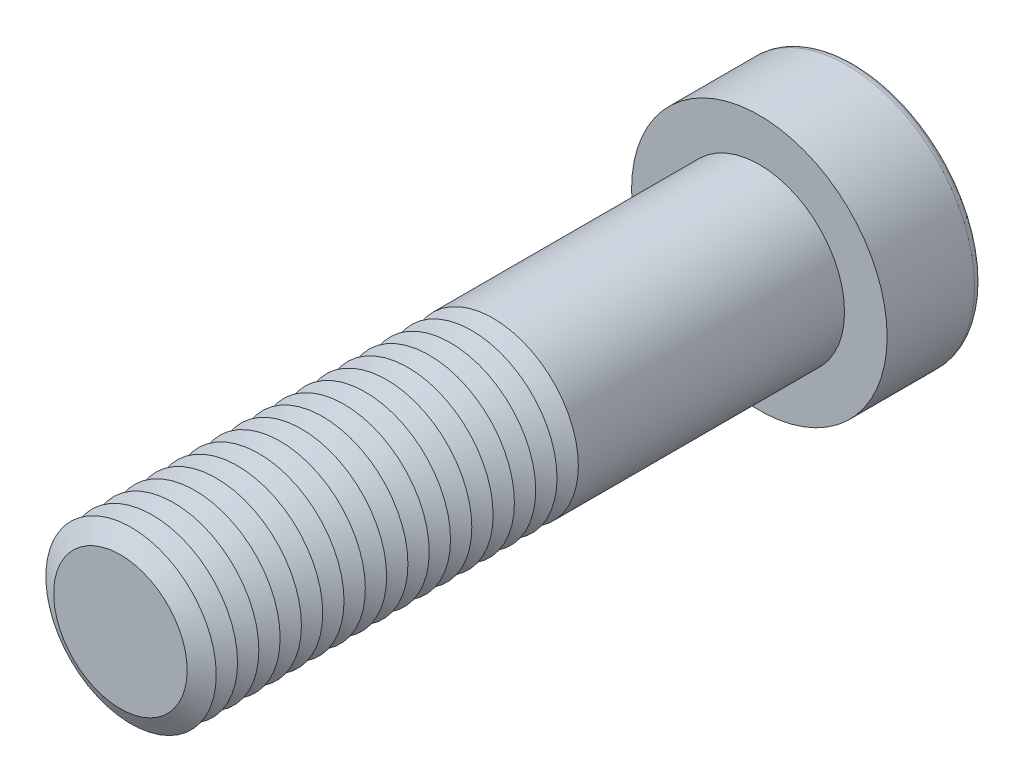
ISO-10303-21;
HEADER;
FILE_DESCRIPTION(('STEP AP214'),'2;1');
FILE_NAME('part.step','',(''),(''),'','','');
FILE_SCHEMA(('AUTOMOTIVE_DESIGN { 1 0 10303 214 1 1 1 1 }'));
ENDSEC;
DATA;
#1=APPLICATION_CONTEXT('core data for automotive mechanical design processes');
#2=APPLICATION_PROTOCOL_DEFINITION('international standard','automotive_design',2000,#1);
#3=PRODUCT_CONTEXT('',#1,'mechanical');
#4=PRODUCT('Part','Part','',(#3));
#5=PRODUCT_RELATED_PRODUCT_CATEGORY('part','',(#4));
#6=PRODUCT_DEFINITION_FORMATION('','',#4);
#7=PRODUCT_DEFINITION_CONTEXT('part definition',#1,'design');
#8=PRODUCT_DEFINITION('design','',#6,#7);
#9=PRODUCT_DEFINITION_SHAPE('','',#8);
#10=(LENGTH_UNIT() NAMED_UNIT(*) SI_UNIT(.MILLI.,.METRE.));
#11=(NAMED_UNIT(*) PLANE_ANGLE_UNIT() SI_UNIT($,.RADIAN.));
#12=(NAMED_UNIT(*) SI_UNIT($,.STERADIAN.) SOLID_ANGLE_UNIT());
#13=UNCERTAINTY_MEASURE_WITH_UNIT(LENGTH_MEASURE(1.E-05),#10,'distance_accuracy_value','');
#14=(GEOMETRIC_REPRESENTATION_CONTEXT(3) GLOBAL_UNCERTAINTY_ASSIGNED_CONTEXT((#13)) GLOBAL_UNIT_ASSIGNED_CONTEXT((#10,
#11,#12)) REPRESENTATION_CONTEXT('',''));
#15=CARTESIAN_POINT('',(0.,0.,0.));
#16=DIRECTION('',(0.,0.,1.));
#17=DIRECTION('',(1.,0.,0.));
#18=AXIS2_PLACEMENT_3D('',#15,#16,#17);
#19=CARTESIAN_POINT('',(0.,0.,53.));
#20=DIRECTION('',(0.,0.,1.));
#21=DIRECTION('',(1.,0.,0.));
#22=AXIS2_PLACEMENT_3D('',#19,#20,#21);
#23=CONICAL_SURFACE('',#22,8.,1.0471975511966);
#24=CARTESIAN_POINT('',(0.,0.,52.));
#25=DIRECTION('',(0.,0.,1.));
#26=DIRECTION('',(1.,0.,0.));
#27=AXIS2_PLACEMENT_3D('',#24,#25,#26);
#28=CIRCLE('',#27,6.26794919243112);
#29=CARTESIAN_POINT('',(6.26794919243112,0.,52.));
#30=VERTEX_POINT('',#29);
#31=EDGE_CURVE('E313',#30,#30,#28,.T.);
#32=ORIENTED_EDGE('',*,*,#31,.T.);
#33=EDGE_LOOP('',(#32));
#34=FACE_BOUND('',#33,.T.);
#35=CARTESIAN_POINT('',(0.,0.,53.));
#36=DIRECTION('',(0.,0.,1.));
#37=DIRECTION('',(1.,0.,0.));
#38=AXIS2_PLACEMENT_3D('',#35,#36,#37);
#39=CIRCLE('',#38,8.);
#40=CARTESIAN_POINT('',(8.,0.,53.));
#41=VERTEX_POINT('',#40);
#42=EDGE_CURVE('E316',#41,#41,#39,.T.);
#43=ORIENTED_EDGE('',*,*,#42,.F.);
#44=EDGE_LOOP('',(#43));
#45=FACE_BOUND('',#44,.T.);
#46=ADVANCED_FACE('F39',(#34,#45),#23,.T.);
#47=CARTESIAN_POINT('',(0.,0.,52.));
#48=DIRECTION('',(0.,0.,-1.));
#49=DIRECTION('',(-1.,0.,0.));
#50=AXIS2_PLACEMENT_3D('',#47,#48,#49);
#51=CONICAL_SURFACE('',#50,6.26794919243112,1.0471975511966);
#52=CARTESIAN_POINT('',(0.,0.,51.));
#53=DIRECTION('',(0.,0.,1.));
#54=DIRECTION('',(1.,0.,0.));
#55=AXIS2_PLACEMENT_3D('',#52,#53,#54);
#56=CIRCLE('',#55,8.);
#57=CARTESIAN_POINT('',(8.,0.,51.));
#58=VERTEX_POINT('',#57);
#59=EDGE_CURVE('E324',#58,#58,#56,.T.);
#60=ORIENTED_EDGE('',*,*,#59,.T.);
#61=EDGE_LOOP('',(#60));
#62=FACE_BOUND('',#61,.T.);
#63=ORIENTED_EDGE('',*,*,#31,.F.);
#64=EDGE_LOOP('',(#63));
#65=FACE_BOUND('',#64,.T.);
#66=ADVANCED_FACE('F244',(#62,#65),#51,.T.);
#67=CARTESIAN_POINT('',(0.,0.,60.));
#68=DIRECTION('',(0.,0.,1.));
#69=DIRECTION('',(1.,0.,0.));
#70=AXIS2_PLACEMENT_3D('',#67,#68,#69);
#71=PLANE('',#70);
#72=CARTESIAN_POINT('',(0.,0.,60.));
#73=DIRECTION('',(0.,0.,1.));
#74=DIRECTION('',(1.,0.,0.));
#75=AXIS2_PLACEMENT_3D('',#72,#73,#74);
#76=CIRCLE('',#75,6.26794919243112);
#77=CARTESIAN_POINT('',(6.26794919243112,0.,60.));
#78=VERTEX_POINT('',#77);
#79=EDGE_CURVE('E173',#78,#78,#76,.T.);
#80=ORIENTED_EDGE('',*,*,#79,.T.);
#81=EDGE_LOOP('',(#80));
#82=FACE_BOUND('',#81,.T.);
#83=ADVANCED_FACE('F250',(#82),#71,.T.);
#84=CARTESIAN_POINT('',(0.,0.,60.));
#85=DIRECTION('',(0.,0.,-1.));
#86=DIRECTION('',(-1.,0.,0.));
#87=AXIS2_PLACEMENT_3D('',#84,#85,#86);
#88=CONICAL_SURFACE('',#87,6.26794919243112,1.0471975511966);
#89=CARTESIAN_POINT('',(0.,0.,59.));
#90=DIRECTION('',(0.,0.,1.));
#91=DIRECTION('',(1.,0.,0.));
#92=AXIS2_PLACEMENT_3D('',#89,#90,#91);
#93=CIRCLE('',#92,8.);
#94=CARTESIAN_POINT('',(8.,0.,59.));
#95=VERTEX_POINT('',#94);
#96=EDGE_CURVE('E290',#95,#95,#93,.T.);
#97=ORIENTED_EDGE('',*,*,#96,.T.);
#98=EDGE_LOOP('',(#97));
#99=FACE_BOUND('',#98,.T.);
#100=ORIENTED_EDGE('',*,*,#79,.F.);
#101=EDGE_LOOP('',(#100));
#102=FACE_BOUND('',#101,.T.);
#103=ADVANCED_FACE('F198',(#99,#102),#88,.T.);
#104=CARTESIAN_POINT('',(0.,0.,59.));
#105=DIRECTION('',(0.,0.,1.));
#106=DIRECTION('',(1.,0.,0.));
#107=AXIS2_PLACEMENT_3D('',#104,#105,#106);
#108=CONICAL_SURFACE('',#107,8.,1.0471975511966);
#109=CARTESIAN_POINT('',(0.,0.,58.));
#110=DIRECTION('',(0.,0.,1.));
#111=DIRECTION('',(1.,0.,0.));
#112=AXIS2_PLACEMENT_3D('',#109,#110,#111);
#113=CIRCLE('',#112,6.26794919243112);
#114=CARTESIAN_POINT('',(6.26794919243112,0.,58.));
#115=VERTEX_POINT('',#114);
#116=EDGE_CURVE('E287',#115,#115,#113,.T.);
#117=ORIENTED_EDGE('',*,*,#116,.T.);
#118=EDGE_LOOP('',(#117));
#119=FACE_BOUND('',#118,.T.);
#120=ORIENTED_EDGE('',*,*,#96,.F.);
#121=EDGE_LOOP('',(#120));
#122=FACE_BOUND('',#121,.T.);
#123=ADVANCED_FACE('F276',(#119,#122),#108,.T.);
#124=CARTESIAN_POINT('',(0.,0.,58.));
#125=DIRECTION('',(0.,0.,-1.));
#126=DIRECTION('',(-1.,0.,0.));
#127=AXIS2_PLACEMENT_3D('',#124,#125,#126);
#128=CONICAL_SURFACE('',#127,6.26794919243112,1.0471975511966);
#129=CARTESIAN_POINT('',(0.,0.,57.));
#130=DIRECTION('',(0.,0.,1.));
#131=DIRECTION('',(1.,0.,0.));
#132=AXIS2_PLACEMENT_3D('',#129,#130,#131);
#133=CIRCLE('',#132,8.);
#134=CARTESIAN_POINT('',(8.,0.,57.));
#135=VERTEX_POINT('',#134);
#136=EDGE_CURVE('E299',#135,#135,#133,.T.);
#137=ORIENTED_EDGE('',*,*,#136,.T.);
#138=EDGE_LOOP('',(#137));
#139=FACE_BOUND('',#138,.T.);
#140=ORIENTED_EDGE('',*,*,#116,.F.);
#141=EDGE_LOOP('',(#140));
#142=FACE_BOUND('',#141,.T.);
#143=ADVANCED_FACE('F273',(#139,#142),#128,.T.);
#144=CARTESIAN_POINT('',(0.,0.,57.));
#145=DIRECTION('',(0.,0.,1.));
#146=DIRECTION('',(1.,0.,0.));
#147=AXIS2_PLACEMENT_3D('',#144,#145,#146);
#148=CONICAL_SURFACE('',#147,8.,1.0471975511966);
#149=CARTESIAN_POINT('',(0.,0.,56.));
#150=DIRECTION('',(0.,0.,1.));
#151=DIRECTION('',(1.,0.,0.));
#152=AXIS2_PLACEMENT_3D('',#149,#150,#151);
#153=CIRCLE('',#152,6.26794919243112);
#154=CARTESIAN_POINT('',(6.26794919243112,0.,56.));
#155=VERTEX_POINT('',#154);
#156=EDGE_CURVE('E292',#155,#155,#153,.T.);
#157=ORIENTED_EDGE('',*,*,#156,.T.);
#158=EDGE_LOOP('',(#157));
#159=FACE_BOUND('',#158,.T.);
#160=ORIENTED_EDGE('',*,*,#136,.F.);
#161=EDGE_LOOP('',(#160));
#162=FACE_BOUND('',#161,.T.);
#163=ADVANCED_FACE('F269',(#159,#162),#148,.T.);
#164=CARTESIAN_POINT('',(0.,0.,56.));
#165=DIRECTION('',(0.,0.,-1.));
#166=DIRECTION('',(-1.,0.,0.));
#167=AXIS2_PLACEMENT_3D('',#164,#165,#166);
#168=CONICAL_SURFACE('',#167,6.26794919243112,1.0471975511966);
#169=CARTESIAN_POINT('',(0.,0.,55.));
#170=DIRECTION('',(0.,0.,1.));
#171=DIRECTION('',(1.,0.,0.));
#172=AXIS2_PLACEMENT_3D('',#169,#170,#171);
#173=CIRCLE('',#172,8.);
#174=CARTESIAN_POINT('',(8.,0.,55.));
#175=VERTEX_POINT('',#174);
#176=EDGE_CURVE('E309',#175,#175,#173,.T.);
#177=ORIENTED_EDGE('',*,*,#176,.T.);
#178=EDGE_LOOP('',(#177));
#179=FACE_BOUND('',#178,.T.);
#180=ORIENTED_EDGE('',*,*,#156,.F.);
#181=EDGE_LOOP('',(#180));
#182=FACE_BOUND('',#181,.T.);
#183=ADVANCED_FACE('F265',(#179,#182),#168,.T.);
#184=CARTESIAN_POINT('',(0.,0.,55.));
#185=DIRECTION('',(0.,0.,1.));
#186=DIRECTION('',(1.,0.,0.));
#187=AXIS2_PLACEMENT_3D('',#184,#185,#186);
#188=CONICAL_SURFACE('',#187,8.,1.0471975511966);
#189=CARTESIAN_POINT('',(0.,0.,54.));
#190=DIRECTION('',(0.,0.,1.));
#191=DIRECTION('',(1.,0.,0.));
#192=AXIS2_PLACEMENT_3D('',#189,#190,#191);
#193=CIRCLE('',#192,6.26794919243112);
#194=CARTESIAN_POINT('',(6.26794919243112,0.,54.));
#195=VERTEX_POINT('',#194);
#196=EDGE_CURVE('E305',#195,#195,#193,.T.);
#197=ORIENTED_EDGE('',*,*,#196,.T.);
#198=EDGE_LOOP('',(#197));
#199=FACE_BOUND('',#198,.T.);
#200=ORIENTED_EDGE('',*,*,#176,.F.);
#201=EDGE_LOOP('',(#200));
#202=FACE_BOUND('',#201,.T.);
#203=ADVANCED_FACE('F261',(#199,#202),#188,.T.);
#204=CARTESIAN_POINT('',(0.,0.,54.));
#205=DIRECTION('',(0.,0.,-1.));
#206=DIRECTION('',(-1.,0.,0.));
#207=AXIS2_PLACEMENT_3D('',#204,#205,#206);
#208=CONICAL_SURFACE('',#207,6.26794919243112,1.0471975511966);
#209=ORIENTED_EDGE('',*,*,#42,.T.);
#210=EDGE_LOOP('',(#209));
#211=FACE_BOUND('',#210,.T.);
#212=ORIENTED_EDGE('',*,*,#196,.F.);
#213=EDGE_LOOP('',(#212));
#214=FACE_BOUND('',#213,.T.);
#215=ADVANCED_FACE('F257',(#211,#214),#208,.T.);
#216=CARTESIAN_POINT('',(0.,0.,51.));
#217=DIRECTION('',(0.,0.,1.));
#218=DIRECTION('',(1.,0.,0.));
#219=AXIS2_PLACEMENT_3D('',#216,#217,#218);
#220=CONICAL_SURFACE('',#219,8.,1.0471975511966);
#221=CARTESIAN_POINT('',(0.,0.,50.));
#222=DIRECTION('',(0.,0.,1.));
#223=DIRECTION('',(1.,0.,0.));
#224=AXIS2_PLACEMENT_3D('',#221,#222,#223);
#225=CIRCLE('',#224,6.26794919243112);
#226=CARTESIAN_POINT('',(6.26794919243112,0.,50.));
#227=VERTEX_POINT('',#226);
#228=EDGE_CURVE('E320',#227,#227,#225,.T.);
#229=ORIENTED_EDGE('',*,*,#228,.T.);
#230=EDGE_LOOP('',(#229));
#231=FACE_BOUND('',#230,.T.);
#232=ORIENTED_EDGE('',*,*,#59,.F.);
#233=EDGE_LOOP('',(#232));
#234=FACE_BOUND('',#233,.T.);
#235=ADVANCED_FACE('F260',(#231,#234),#220,.T.);
#236=CARTESIAN_POINT('',(0.,0.,50.));
#237=DIRECTION('',(0.,0.,-1.));
#238=DIRECTION('',(-1.,0.,0.));
#239=AXIS2_PLACEMENT_3D('',#236,#237,#238);
#240=CONICAL_SURFACE('',#239,6.26794919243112,1.0471975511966);
#241=CARTESIAN_POINT('',(0.,0.,49.));
#242=DIRECTION('',(0.,0.,1.));
#243=DIRECTION('',(1.,0.,0.));
#244=AXIS2_PLACEMENT_3D('',#241,#242,#243);
#245=CIRCLE('',#244,8.);
#246=CARTESIAN_POINT('',(8.,0.,49.));
#247=VERTEX_POINT('',#246);
#248=EDGE_CURVE('E332',#247,#247,#245,.T.);
#249=ORIENTED_EDGE('',*,*,#248,.T.);
#250=EDGE_LOOP('',(#249));
#251=FACE_BOUND('',#250,.T.);
#252=ORIENTED_EDGE('',*,*,#228,.F.);
#253=EDGE_LOOP('',(#252));
#254=FACE_BOUND('',#253,.T.);
#255=ADVANCED_FACE('F528',(#251,#254),#240,.T.);
#256=CARTESIAN_POINT('',(0.,0.,49.));
#257=DIRECTION('',(0.,0.,1.));
#258=DIRECTION('',(1.,0.,0.));
#259=AXIS2_PLACEMENT_3D('',#256,#257,#258);
#260=CONICAL_SURFACE('',#259,8.,1.0471975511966);
#261=CARTESIAN_POINT('',(0.,0.,48.));
#262=DIRECTION('',(0.,0.,1.));
#263=DIRECTION('',(1.,0.,0.));
#264=AXIS2_PLACEMENT_3D('',#261,#262,#263);
#265=CIRCLE('',#264,6.26794919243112);
#266=CARTESIAN_POINT('',(6.26794919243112,0.,48.));
#267=VERTEX_POINT('',#266);
#268=EDGE_CURVE('E328',#267,#267,#265,.T.);
#269=ORIENTED_EDGE('',*,*,#268,.T.);
#270=EDGE_LOOP('',(#269));
#271=FACE_BOUND('',#270,.T.);
#272=ORIENTED_EDGE('',*,*,#248,.F.);
#273=EDGE_LOOP('',(#272));
#274=FACE_BOUND('',#273,.T.);
#275=ADVANCED_FACE('F524',(#271,#274),#260,.T.);
#276=CARTESIAN_POINT('',(0.,0.,48.));
#277=DIRECTION('',(0.,0.,-1.));
#278=DIRECTION('',(-1.,0.,0.));
#279=AXIS2_PLACEMENT_3D('',#276,#277,#278);
#280=CONICAL_SURFACE('',#279,6.26794919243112,1.0471975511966);
#281=CARTESIAN_POINT('',(0.,0.,47.));
#282=DIRECTION('',(0.,0.,1.));
#283=DIRECTION('',(1.,0.,0.));
#284=AXIS2_PLACEMENT_3D('',#281,#282,#283);
#285=CIRCLE('',#284,8.);
#286=CARTESIAN_POINT('',(8.,0.,47.));
#287=VERTEX_POINT('',#286);
#288=EDGE_CURVE('E340',#287,#287,#285,.T.);
#289=ORIENTED_EDGE('',*,*,#288,.T.);
#290=EDGE_LOOP('',(#289));
#291=FACE_BOUND('',#290,.T.);
#292=ORIENTED_EDGE('',*,*,#268,.F.);
#293=EDGE_LOOP('',(#292));
#294=FACE_BOUND('',#293,.T.);
#295=ADVANCED_FACE('F520',(#291,#294),#280,.T.);
#296=CARTESIAN_POINT('',(0.,0.,47.));
#297=DIRECTION('',(0.,0.,1.));
#298=DIRECTION('',(1.,0.,0.));
#299=AXIS2_PLACEMENT_3D('',#296,#297,#298);
#300=CONICAL_SURFACE('',#299,8.,1.0471975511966);
#301=CARTESIAN_POINT('',(0.,0.,46.));
#302=DIRECTION('',(0.,0.,1.));
#303=DIRECTION('',(1.,0.,0.));
#304=AXIS2_PLACEMENT_3D('',#301,#302,#303);
#305=CIRCLE('',#304,6.26794919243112);
#306=CARTESIAN_POINT('',(6.26794919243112,0.,46.));
#307=VERTEX_POINT('',#306);
#308=EDGE_CURVE('E336',#307,#307,#305,.T.);
#309=ORIENTED_EDGE('',*,*,#308,.T.);
#310=EDGE_LOOP('',(#309));
#311=FACE_BOUND('',#310,.T.);
#312=ORIENTED_EDGE('',*,*,#288,.F.);
#313=EDGE_LOOP('',(#312));
#314=FACE_BOUND('',#313,.T.);
#315=ADVANCED_FACE('F516',(#311,#314),#300,.T.);
#316=CARTESIAN_POINT('',(0.,0.,46.));
#317=DIRECTION('',(0.,0.,-1.));
#318=DIRECTION('',(-1.,0.,0.));
#319=AXIS2_PLACEMENT_3D('',#316,#317,#318);
#320=CONICAL_SURFACE('',#319,6.26794919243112,1.0471975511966);
#321=CARTESIAN_POINT('',(0.,0.,45.));
#322=DIRECTION('',(0.,0.,1.));
#323=DIRECTION('',(1.,0.,0.));
#324=AXIS2_PLACEMENT_3D('',#321,#322,#323);
#325=CIRCLE('',#324,8.);
#326=CARTESIAN_POINT('',(8.,0.,45.));
#327=VERTEX_POINT('',#326);
#328=EDGE_CURVE('E348',#327,#327,#325,.T.);
#329=ORIENTED_EDGE('',*,*,#328,.T.);
#330=EDGE_LOOP('',(#329));
#331=FACE_BOUND('',#330,.T.);
#332=ORIENTED_EDGE('',*,*,#308,.F.);
#333=EDGE_LOOP('',(#332));
#334=FACE_BOUND('',#333,.T.);
#335=ADVANCED_FACE('F512',(#331,#334),#320,.T.);
#336=CARTESIAN_POINT('',(0.,0.,45.));
#337=DIRECTION('',(0.,0.,1.));
#338=DIRECTION('',(1.,0.,0.));
#339=AXIS2_PLACEMENT_3D('',#336,#337,#338);
#340=CONICAL_SURFACE('',#339,8.,1.0471975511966);
#341=CARTESIAN_POINT('',(0.,0.,44.));
#342=DIRECTION('',(0.,0.,1.));
#343=DIRECTION('',(1.,0.,0.));
#344=AXIS2_PLACEMENT_3D('',#341,#342,#343);
#345=CIRCLE('',#344,6.26794919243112);
#346=CARTESIAN_POINT('',(6.26794919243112,0.,44.));
#347=VERTEX_POINT('',#346);
#348=EDGE_CURVE('E344',#347,#347,#345,.T.);
#349=ORIENTED_EDGE('',*,*,#348,.T.);
#350=EDGE_LOOP('',(#349));
#351=FACE_BOUND('',#350,.T.);
#352=ORIENTED_EDGE('',*,*,#328,.F.);
#353=EDGE_LOOP('',(#352));
#354=FACE_BOUND('',#353,.T.);
#355=ADVANCED_FACE('F508',(#351,#354),#340,.T.);
#356=CARTESIAN_POINT('',(0.,0.,44.));
#357=DIRECTION('',(0.,0.,-1.));
#358=DIRECTION('',(-1.,0.,0.));
#359=AXIS2_PLACEMENT_3D('',#356,#357,#358);
#360=CONICAL_SURFACE('',#359,6.26794919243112,1.0471975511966);
#361=CARTESIAN_POINT('',(0.,0.,43.));
#362=DIRECTION('',(0.,0.,1.));
#363=DIRECTION('',(1.,0.,0.));
#364=AXIS2_PLACEMENT_3D('',#361,#362,#363);
#365=CIRCLE('',#364,8.);
#366=CARTESIAN_POINT('',(8.,0.,43.));
#367=VERTEX_POINT('',#366);
#368=EDGE_CURVE('E356',#367,#367,#365,.T.);
#369=ORIENTED_EDGE('',*,*,#368,.T.);
#370=EDGE_LOOP('',(#369));
#371=FACE_BOUND('',#370,.T.);
#372=ORIENTED_EDGE('',*,*,#348,.F.);
#373=EDGE_LOOP('',(#372));
#374=FACE_BOUND('',#373,.T.);
#375=ADVANCED_FACE('F504',(#371,#374),#360,.T.);
#376=CARTESIAN_POINT('',(0.,0.,43.));
#377=DIRECTION('',(0.,0.,1.));
#378=DIRECTION('',(1.,0.,0.));
#379=AXIS2_PLACEMENT_3D('',#376,#377,#378);
#380=CONICAL_SURFACE('',#379,8.,1.0471975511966);
#381=CARTESIAN_POINT('',(0.,0.,42.));
#382=DIRECTION('',(0.,0.,1.));
#383=DIRECTION('',(1.,0.,0.));
#384=AXIS2_PLACEMENT_3D('',#381,#382,#383);
#385=CIRCLE('',#384,6.26794919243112);
#386=CARTESIAN_POINT('',(6.26794919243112,0.,42.));
#387=VERTEX_POINT('',#386);
#388=EDGE_CURVE('E352',#387,#387,#385,.T.);
#389=ORIENTED_EDGE('',*,*,#388,.T.);
#390=EDGE_LOOP('',(#389));
#391=FACE_BOUND('',#390,.T.);
#392=ORIENTED_EDGE('',*,*,#368,.F.);
#393=EDGE_LOOP('',(#392));
#394=FACE_BOUND('',#393,.T.);
#395=ADVANCED_FACE('F500',(#391,#394),#380,.T.);
#396=CARTESIAN_POINT('',(0.,0.,42.));
#397=DIRECTION('',(0.,0.,-1.));
#398=DIRECTION('',(-1.,0.,0.));
#399=AXIS2_PLACEMENT_3D('',#396,#397,#398);
#400=CONICAL_SURFACE('',#399,6.26794919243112,1.0471975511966);
#401=CARTESIAN_POINT('',(0.,0.,41.));
#402=DIRECTION('',(0.,0.,1.));
#403=DIRECTION('',(1.,0.,0.));
#404=AXIS2_PLACEMENT_3D('',#401,#402,#403);
#405=CIRCLE('',#404,8.);
#406=CARTESIAN_POINT('',(8.,0.,41.));
#407=VERTEX_POINT('',#406);
#408=EDGE_CURVE('E364',#407,#407,#405,.T.);
#409=ORIENTED_EDGE('',*,*,#408,.T.);
#410=EDGE_LOOP('',(#409));
#411=FACE_BOUND('',#410,.T.);
#412=ORIENTED_EDGE('',*,*,#388,.F.);
#413=EDGE_LOOP('',(#412));
#414=FACE_BOUND('',#413,.T.);
#415=ADVANCED_FACE('F496',(#411,#414),#400,.T.);
#416=CARTESIAN_POINT('',(0.,0.,41.));
#417=DIRECTION('',(0.,0.,1.));
#418=DIRECTION('',(1.,0.,0.));
#419=AXIS2_PLACEMENT_3D('',#416,#417,#418);
#420=CONICAL_SURFACE('',#419,8.,1.0471975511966);
#421=CARTESIAN_POINT('',(0.,0.,40.));
#422=DIRECTION('',(0.,0.,1.));
#423=DIRECTION('',(1.,0.,0.));
#424=AXIS2_PLACEMENT_3D('',#421,#422,#423);
#425=CIRCLE('',#424,6.26794919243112);
#426=CARTESIAN_POINT('',(6.26794919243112,0.,40.));
#427=VERTEX_POINT('',#426);
#428=EDGE_CURVE('E360',#427,#427,#425,.T.);
#429=ORIENTED_EDGE('',*,*,#428,.T.);
#430=EDGE_LOOP('',(#429));
#431=FACE_BOUND('',#430,.T.);
#432=ORIENTED_EDGE('',*,*,#408,.F.);
#433=EDGE_LOOP('',(#432));
#434=FACE_BOUND('',#433,.T.);
#435=ADVANCED_FACE('F492',(#431,#434),#420,.T.);
#436=CARTESIAN_POINT('',(0.,0.,40.));
#437=DIRECTION('',(0.,0.,-1.));
#438=DIRECTION('',(-1.,0.,0.));
#439=AXIS2_PLACEMENT_3D('',#436,#437,#438);
#440=CONICAL_SURFACE('',#439,6.26794919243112,1.0471975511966);
#441=CARTESIAN_POINT('',(0.,0.,39.));
#442=DIRECTION('',(0.,0.,1.));
#443=DIRECTION('',(1.,0.,0.));
#444=AXIS2_PLACEMENT_3D('',#441,#442,#443);
#445=CIRCLE('',#444,8.);
#446=CARTESIAN_POINT('',(8.,0.,39.));
#447=VERTEX_POINT('',#446);
#448=EDGE_CURVE('E371',#447,#447,#445,.T.);
#449=ORIENTED_EDGE('',*,*,#448,.T.);
#450=EDGE_LOOP('',(#449));
#451=FACE_BOUND('',#450,.T.);
#452=ORIENTED_EDGE('',*,*,#428,.F.);
#453=EDGE_LOOP('',(#452));
#454=FACE_BOUND('',#453,.T.);
#455=ADVANCED_FACE('F488',(#451,#454),#440,.T.);
#456=CARTESIAN_POINT('',(0.,0.,39.));
#457=DIRECTION('',(0.,0.,1.));
#458=DIRECTION('',(1.,0.,0.));
#459=AXIS2_PLACEMENT_3D('',#456,#457,#458);
#460=CONICAL_SURFACE('',#459,8.,1.0471975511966);
#461=CARTESIAN_POINT('',(0.,0.,38.));
#462=DIRECTION('',(0.,0.,1.));
#463=DIRECTION('',(1.,0.,0.));
#464=AXIS2_PLACEMENT_3D('',#461,#462,#463);
#465=CIRCLE('',#464,6.26794919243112);
#466=CARTESIAN_POINT('',(6.26794919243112,0.,38.));
#467=VERTEX_POINT('',#466);
#468=EDGE_CURVE('E368',#467,#467,#465,.T.);
#469=ORIENTED_EDGE('',*,*,#468,.T.);
#470=EDGE_LOOP('',(#469));
#471=FACE_BOUND('',#470,.T.);
#472=ORIENTED_EDGE('',*,*,#448,.F.);
#473=EDGE_LOOP('',(#472));
#474=FACE_BOUND('',#473,.T.);
#475=ADVANCED_FACE('F484',(#471,#474),#460,.T.);
#476=CARTESIAN_POINT('',(0.,0.,38.));
#477=DIRECTION('',(0.,0.,-1.));
#478=DIRECTION('',(-1.,0.,0.));
#479=AXIS2_PLACEMENT_3D('',#476,#477,#478);
#480=CONICAL_SURFACE('',#479,6.26794919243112,1.0471975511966);
#481=CARTESIAN_POINT('',(0.,0.,37.));
#482=DIRECTION('',(0.,0.,1.));
#483=DIRECTION('',(1.,0.,0.));
#484=AXIS2_PLACEMENT_3D('',#481,#482,#483);
#485=CIRCLE('',#484,8.);
#486=CARTESIAN_POINT('',(8.,0.,37.));
#487=VERTEX_POINT('',#486);
#488=EDGE_CURVE('E379',#487,#487,#485,.T.);
#489=ORIENTED_EDGE('',*,*,#488,.T.);
#490=EDGE_LOOP('',(#489));
#491=FACE_BOUND('',#490,.T.);
#492=ORIENTED_EDGE('',*,*,#468,.F.);
#493=EDGE_LOOP('',(#492));
#494=FACE_BOUND('',#493,.T.);
#495=ADVANCED_FACE('F480',(#491,#494),#480,.T.);
#496=CARTESIAN_POINT('',(0.,0.,37.));
#497=DIRECTION('',(0.,0.,1.));
#498=DIRECTION('',(1.,0.,0.));
#499=AXIS2_PLACEMENT_3D('',#496,#497,#498);
#500=CONICAL_SURFACE('',#499,8.,1.0471975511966);
#501=CARTESIAN_POINT('',(0.,0.,36.));
#502=DIRECTION('',(0.,0.,1.));
#503=DIRECTION('',(1.,0.,0.));
#504=AXIS2_PLACEMENT_3D('',#501,#502,#503);
#505=CIRCLE('',#504,6.26794919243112);
#506=CARTESIAN_POINT('',(6.26794919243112,0.,36.));
#507=VERTEX_POINT('',#506);
#508=EDGE_CURVE('E375',#507,#507,#505,.T.);
#509=ORIENTED_EDGE('',*,*,#508,.T.);
#510=EDGE_LOOP('',(#509));
#511=FACE_BOUND('',#510,.T.);
#512=ORIENTED_EDGE('',*,*,#488,.F.);
#513=EDGE_LOOP('',(#512));
#514=FACE_BOUND('',#513,.T.);
#515=ADVANCED_FACE('F476',(#511,#514),#500,.T.);
#516=CARTESIAN_POINT('',(0.,0.,36.));
#517=DIRECTION('',(0.,0.,-1.));
#518=DIRECTION('',(-1.,0.,0.));
#519=AXIS2_PLACEMENT_3D('',#516,#517,#518);
#520=CONICAL_SURFACE('',#519,6.26794919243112,1.0471975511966);
#521=CARTESIAN_POINT('',(0.,0.,35.));
#522=DIRECTION('',(0.,0.,1.));
#523=DIRECTION('',(1.,0.,0.));
#524=AXIS2_PLACEMENT_3D('',#521,#522,#523);
#525=CIRCLE('',#524,8.);
#526=CARTESIAN_POINT('',(8.,0.,35.));
#527=VERTEX_POINT('',#526);
#528=EDGE_CURVE('E387',#527,#527,#525,.T.);
#529=ORIENTED_EDGE('',*,*,#528,.T.);
#530=EDGE_LOOP('',(#529));
#531=FACE_BOUND('',#530,.T.);
#532=ORIENTED_EDGE('',*,*,#508,.F.);
#533=EDGE_LOOP('',(#532));
#534=FACE_BOUND('',#533,.T.);
#535=ADVANCED_FACE('F472',(#531,#534),#520,.T.);
#536=CARTESIAN_POINT('',(0.,0.,35.));
#537=DIRECTION('',(0.,0.,1.));
#538=DIRECTION('',(1.,0.,0.));
#539=AXIS2_PLACEMENT_3D('',#536,#537,#538);
#540=CONICAL_SURFACE('',#539,8.,1.0471975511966);
#541=CARTESIAN_POINT('',(0.,0.,34.));
#542=DIRECTION('',(0.,0.,1.));
#543=DIRECTION('',(1.,0.,0.));
#544=AXIS2_PLACEMENT_3D('',#541,#542,#543);
#545=CIRCLE('',#544,6.26794919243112);
#546=CARTESIAN_POINT('',(6.26794919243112,0.,34.));
#547=VERTEX_POINT('',#546);
#548=EDGE_CURVE('E383',#547,#547,#545,.T.);
#549=ORIENTED_EDGE('',*,*,#548,.T.);
#550=EDGE_LOOP('',(#549));
#551=FACE_BOUND('',#550,.T.);
#552=ORIENTED_EDGE('',*,*,#528,.F.);
#553=EDGE_LOOP('',(#552));
#554=FACE_BOUND('',#553,.T.);
#555=ADVANCED_FACE('F468',(#551,#554),#540,.T.);
#556=CARTESIAN_POINT('',(0.,0.,34.));
#557=DIRECTION('',(0.,0.,-1.));
#558=DIRECTION('',(-1.,0.,0.));
#559=AXIS2_PLACEMENT_3D('',#556,#557,#558);
#560=CONICAL_SURFACE('',#559,6.26794919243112,1.0471975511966);
#561=CARTESIAN_POINT('',(0.,0.,33.));
#562=DIRECTION('',(0.,0.,1.));
#563=DIRECTION('',(1.,0.,0.));
#564=AXIS2_PLACEMENT_3D('',#561,#562,#563);
#565=CIRCLE('',#564,8.);
#566=CARTESIAN_POINT('',(8.,0.,33.));
#567=VERTEX_POINT('',#566);
#568=EDGE_CURVE('E395',#567,#567,#565,.T.);
#569=ORIENTED_EDGE('',*,*,#568,.T.);
#570=EDGE_LOOP('',(#569));
#571=FACE_BOUND('',#570,.T.);
#572=ORIENTED_EDGE('',*,*,#548,.F.);
#573=EDGE_LOOP('',(#572));
#574=FACE_BOUND('',#573,.T.);
#575=ADVANCED_FACE('F464',(#571,#574),#560,.T.);
#576=CARTESIAN_POINT('',(0.,0.,33.));
#577=DIRECTION('',(0.,0.,1.));
#578=DIRECTION('',(1.,0.,0.));
#579=AXIS2_PLACEMENT_3D('',#576,#577,#578);
#580=CONICAL_SURFACE('',#579,8.,1.0471975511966);
#581=CARTESIAN_POINT('',(0.,0.,32.));
#582=DIRECTION('',(0.,0.,1.));
#583=DIRECTION('',(1.,0.,0.));
#584=AXIS2_PLACEMENT_3D('',#581,#582,#583);
#585=CIRCLE('',#584,6.26794919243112);
#586=CARTESIAN_POINT('',(6.26794919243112,0.,32.));
#587=VERTEX_POINT('',#586);
#588=EDGE_CURVE('E391',#587,#587,#585,.T.);
#589=ORIENTED_EDGE('',*,*,#588,.T.);
#590=EDGE_LOOP('',(#589));
#591=FACE_BOUND('',#590,.T.);
#592=ORIENTED_EDGE('',*,*,#568,.F.);
#593=EDGE_LOOP('',(#592));
#594=FACE_BOUND('',#593,.T.);
#595=ADVANCED_FACE('F460',(#591,#594),#580,.T.);
#596=CARTESIAN_POINT('',(0.,0.,32.));
#597=DIRECTION('',(0.,0.,-1.));
#598=DIRECTION('',(-1.,0.,0.));
#599=AXIS2_PLACEMENT_3D('',#596,#597,#598);
#600=CONICAL_SURFACE('',#599,6.26794919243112,1.0471975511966);
#601=CARTESIAN_POINT('',(0.,0.,31.));
#602=DIRECTION('',(0.,0.,1.));
#603=DIRECTION('',(1.,0.,0.));
#604=AXIS2_PLACEMENT_3D('',#601,#602,#603);
#605=CIRCLE('',#604,8.);
#606=CARTESIAN_POINT('',(8.,0.,31.));
#607=VERTEX_POINT('',#606);
#608=EDGE_CURVE('E403',#607,#607,#605,.T.);
#609=ORIENTED_EDGE('',*,*,#608,.T.);
#610=EDGE_LOOP('',(#609));
#611=FACE_BOUND('',#610,.T.);
#612=ORIENTED_EDGE('',*,*,#588,.F.);
#613=EDGE_LOOP('',(#612));
#614=FACE_BOUND('',#613,.T.);
#615=ADVANCED_FACE('F456',(#611,#614),#600,.T.);
#616=CARTESIAN_POINT('',(0.,0.,31.));
#617=DIRECTION('',(0.,0.,1.));
#618=DIRECTION('',(1.,0.,0.));
#619=AXIS2_PLACEMENT_3D('',#616,#617,#618);
#620=CONICAL_SURFACE('',#619,8.,1.0471975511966);
#621=CARTESIAN_POINT('',(0.,0.,30.));
#622=DIRECTION('',(0.,0.,1.));
#623=DIRECTION('',(1.,0.,0.));
#624=AXIS2_PLACEMENT_3D('',#621,#622,#623);
#625=CIRCLE('',#624,6.26794919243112);
#626=CARTESIAN_POINT('',(6.26794919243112,0.,30.));
#627=VERTEX_POINT('',#626);
#628=EDGE_CURVE('E399',#627,#627,#625,.T.);
#629=ORIENTED_EDGE('',*,*,#628,.T.);
#630=EDGE_LOOP('',(#629));
#631=FACE_BOUND('',#630,.T.);
#632=ORIENTED_EDGE('',*,*,#608,.F.);
#633=EDGE_LOOP('',(#632));
#634=FACE_BOUND('',#633,.T.);
#635=ADVANCED_FACE('F452',(#631,#634),#620,.T.);
#636=CARTESIAN_POINT('',(0.,0.,30.));
#637=DIRECTION('',(0.,0.,-1.));
#638=DIRECTION('',(-1.,0.,0.));
#639=AXIS2_PLACEMENT_3D('',#636,#637,#638);
#640=CONICAL_SURFACE('',#639,6.26794919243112,1.0471975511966);
#641=CARTESIAN_POINT('',(0.,0.,29.));
#642=DIRECTION('',(0.,0.,1.));
#643=DIRECTION('',(1.,0.,0.));
#644=AXIS2_PLACEMENT_3D('',#641,#642,#643);
#645=CIRCLE('',#644,8.);
#646=CARTESIAN_POINT('',(8.,0.,29.));
#647=VERTEX_POINT('',#646);
#648=EDGE_CURVE('E411',#647,#647,#645,.T.);
#649=ORIENTED_EDGE('',*,*,#648,.T.);
#650=EDGE_LOOP('',(#649));
#651=FACE_BOUND('',#650,.T.);
#652=ORIENTED_EDGE('',*,*,#628,.F.);
#653=EDGE_LOOP('',(#652));
#654=FACE_BOUND('',#653,.T.);
#655=ADVANCED_FACE('F448',(#651,#654),#640,.T.);
#656=CARTESIAN_POINT('',(0.,0.,29.));
#657=DIRECTION('',(0.,0.,1.));
#658=DIRECTION('',(1.,0.,0.));
#659=AXIS2_PLACEMENT_3D('',#656,#657,#658);
#660=CONICAL_SURFACE('',#659,8.,1.0471975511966);
#661=CARTESIAN_POINT('',(0.,0.,28.));
#662=DIRECTION('',(0.,0.,1.));
#663=DIRECTION('',(1.,0.,0.));
#664=AXIS2_PLACEMENT_3D('',#661,#662,#663);
#665=CIRCLE('',#664,6.26794919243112);
#666=CARTESIAN_POINT('',(6.26794919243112,0.,28.));
#667=VERTEX_POINT('',#666);
#668=EDGE_CURVE('E407',#667,#667,#665,.T.);
#669=ORIENTED_EDGE('',*,*,#668,.T.);
#670=EDGE_LOOP('',(#669));
#671=FACE_BOUND('',#670,.T.);
#672=ORIENTED_EDGE('',*,*,#648,.F.);
#673=EDGE_LOOP('',(#672));
#674=FACE_BOUND('',#673,.T.);
#675=ADVANCED_FACE('F443',(#671,#674),#660,.T.);
#676=CARTESIAN_POINT('',(0.,0.,28.));
#677=DIRECTION('',(0.,0.,-1.));
#678=DIRECTION('',(-1.,0.,0.));
#679=AXIS2_PLACEMENT_3D('',#676,#677,#678);
#680=CONICAL_SURFACE('',#679,6.26794919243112,1.0471975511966);
#681=CARTESIAN_POINT('',(0.,0.,27.));
#682=DIRECTION('',(0.,0.,1.));
#683=DIRECTION('',(1.,0.,0.));
#684=AXIS2_PLACEMENT_3D('',#681,#682,#683);
#685=CIRCLE('',#684,8.);
#686=CARTESIAN_POINT('',(8.,0.,27.));
#687=VERTEX_POINT('',#686);
#688=EDGE_CURVE('E423',#687,#687,#685,.T.);
#689=ORIENTED_EDGE('',*,*,#688,.T.);
#690=EDGE_LOOP('',(#689));
#691=FACE_BOUND('',#690,.T.);
#692=ORIENTED_EDGE('',*,*,#668,.F.);
#693=EDGE_LOOP('',(#692));
#694=FACE_BOUND('',#693,.T.);
#695=ADVANCED_FACE('F429',(#691,#694),#680,.T.);
#696=CARTESIAN_POINT('',(0.,0.,27.));
#697=DIRECTION('',(0.,0.,1.));
#698=DIRECTION('',(1.,0.,0.));
#699=AXIS2_PLACEMENT_3D('',#696,#697,#698);
#700=CONICAL_SURFACE('',#699,8.,1.0471975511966);
#701=CARTESIAN_POINT('',(0.,0.,26.));
#702=DIRECTION('',(0.,0.,1.));
#703=DIRECTION('',(1.,0.,0.));
#704=AXIS2_PLACEMENT_3D('',#701,#702,#703);
#705=CIRCLE('',#704,6.26794919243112);
#706=CARTESIAN_POINT('',(6.26794919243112,0.,26.));
#707=VERTEX_POINT('',#706);
#708=EDGE_CURVE('E415',#707,#707,#705,.T.);
#709=ORIENTED_EDGE('',*,*,#708,.T.);
#710=EDGE_LOOP('',(#709));
#711=FACE_BOUND('',#710,.T.);
#712=ORIENTED_EDGE('',*,*,#688,.F.);
#713=EDGE_LOOP('',(#712));
#714=FACE_BOUND('',#713,.T.);
#715=ADVANCED_FACE('F432',(#711,#714),#700,.T.);
#716=CARTESIAN_POINT('',(0.,0.,26.));
#717=DIRECTION('',(0.,0.,-1.));
#718=DIRECTION('',(-1.,0.,0.));
#719=AXIS2_PLACEMENT_3D('',#716,#717,#718);
#720=CONICAL_SURFACE('',#719,6.26794919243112,1.0471975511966);
#721=CARTESIAN_POINT('',(0.,0.,25.));
#722=DIRECTION('',(0.,0.,1.));
#723=DIRECTION('',(1.,0.,0.));
#724=AXIS2_PLACEMENT_3D('',#721,#722,#723);
#725=CIRCLE('',#724,8.);
#726=CARTESIAN_POINT('',(8.,0.,25.));
#727=VERTEX_POINT('',#726);
#728=EDGE_CURVE('E419',#727,#727,#725,.T.);
#729=ORIENTED_EDGE('',*,*,#728,.T.);
#730=EDGE_LOOP('',(#729));
#731=FACE_BOUND('',#730,.T.);
#732=ORIENTED_EDGE('',*,*,#708,.F.);
#733=EDGE_LOOP('',(#732));
#734=FACE_BOUND('',#733,.T.);
#735=ADVANCED_FACE('F434',(#731,#734),#720,.T.);
#736=CARTESIAN_POINT('',(0.,0.,0.));
#737=DIRECTION('',(0.,0.,-1.));
#738=DIRECTION('',(-1.,0.,0.));
#739=AXIS2_PLACEMENT_3D('',#736,#737,#738);
#740=CONICAL_SURFACE('',#739,6.,1.0471975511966);
#741=CARTESIAN_POINT('',(0.,0.,3.46410161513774));
#742=VERTEX_POINT('',#741);
#743=VERTEX_LOOP('',#742);
#744=FACE_BOUND('',#743,.T.);
#745=CARTESIAN_POINT('',(0.,0.,0.));
#746=DIRECTION('',(0.,0.,-1.));
#747=DIRECTION('',(-1.,0.,0.));
#748=AXIS2_PLACEMENT_3D('',#745,#746,#747);
#749=CIRCLE('',#748,6.);
#750=CARTESIAN_POINT('',(-5.19615242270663,3.,0.));
#751=VERTEX_POINT('',#750);
#752=CARTESIAN_POINT('',(0.,6.,0.));
#753=VERTEX_POINT('',#752);
#754=EDGE_CURVE('E149',#751,#753,#749,.T.);
#755=ORIENTED_EDGE('',*,*,#754,.T.);
#756=CARTESIAN_POINT('',(0.,0.,0.));
#757=DIRECTION('',(0.,0.,-1.));
#758=DIRECTION('',(-1.,0.,0.));
#759=AXIS2_PLACEMENT_3D('',#756,#757,#758);
#760=CIRCLE('',#759,6.);
#761=CARTESIAN_POINT('',(5.19615242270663,3.,0.));
#762=VERTEX_POINT('',#761);
#763=EDGE_CURVE('E54',#753,#762,#760,.T.);
#764=ORIENTED_EDGE('',*,*,#763,.T.);
#765=CARTESIAN_POINT('',(5.19615242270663,-3.,0.));
#766=VERTEX_POINT('',#765);
#767=EDGE_CURVE('E1057',#762,#766,#760,.T.);
#768=ORIENTED_EDGE('',*,*,#767,.T.);
#769=CARTESIAN_POINT('',(0.,-6.,0.));
#770=VERTEX_POINT('',#769);
#771=EDGE_CURVE('E1055',#766,#770,#760,.T.);
#772=ORIENTED_EDGE('',*,*,#771,.T.);
#773=CARTESIAN_POINT('',(-5.19615242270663,-3.,0.));
#774=VERTEX_POINT('',#773);
#775=EDGE_CURVE('E1051',#770,#774,#760,.T.);
#776=ORIENTED_EDGE('',*,*,#775,.T.);
#777=EDGE_CURVE('E1050',#774,#751,#760,.T.);
#778=ORIENTED_EDGE('',*,*,#777,.T.);
#779=EDGE_LOOP('',(#755,#764,#768,#772,#776,#778));
#780=FACE_BOUND('',#779,.T.);
#781=ADVANCED_FACE('F200',(#744,#780),#740,.F.);
#782=CARTESIAN_POINT('',(0.,0.,0.));
#783=DIRECTION('',(0.,0.,-1.));
#784=DIRECTION('',(-1.,0.,0.));
#785=AXIS2_PLACEMENT_3D('',#782,#783,#784);
#786=PLANE('',#785);
#787=ORIENTED_EDGE('',*,*,#763,.F.);
#788=DIRECTION('',(1.,0.,0.));
#789=VECTOR('',#788,1.);
#790=CARTESIAN_POINT('',(-3.46410161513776,6.,0.));
#791=LINE('',#790,#789);
#792=CARTESIAN_POINT('',(3.46410161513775,6.,0.));
#793=VERTEX_POINT('',#792);
#794=EDGE_CURVE('E1092',#753,#793,#791,.T.);
#795=ORIENTED_EDGE('',*,*,#794,.T.);
#796=DIRECTION('',(0.5,-0.866025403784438,0.));
#797=VECTOR('',#796,1.);
#798=CARTESIAN_POINT('',(3.46410161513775,6.,0.));
#799=LINE('',#798,#797);
#800=EDGE_CURVE('E155',#793,#762,#799,.T.);
#801=ORIENTED_EDGE('',*,*,#800,.T.);
#802=EDGE_LOOP('',(#787,#795,#801));
#803=FACE_BOUND('',#802,.T.);
#804=ADVANCED_FACE('F629',(#803),#786,.T.);
#805=ORIENTED_EDGE('',*,*,#767,.F.);
#806=CARTESIAN_POINT('',(6.92820323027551,0.,0.));
#807=VERTEX_POINT('',#806);
#808=EDGE_CURVE('E1097',#762,#807,#799,.T.);
#809=ORIENTED_EDGE('',*,*,#808,.T.);
#810=DIRECTION('',(-0.5,-0.866025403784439,0.));
#811=VECTOR('',#810,1.);
#812=CARTESIAN_POINT('',(6.92820323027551,0.,0.));
#813=LINE('',#812,#811);
#814=EDGE_CURVE('E1069',#807,#766,#813,.T.);
#815=ORIENTED_EDGE('',*,*,#814,.T.);
#816=EDGE_LOOP('',(#805,#809,#815));
#817=FACE_BOUND('',#816,.T.);
#818=ADVANCED_FACE('F639',(#817),#786,.T.);
#819=ORIENTED_EDGE('',*,*,#771,.F.);
#820=CARTESIAN_POINT('',(3.46410161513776,-6.,0.));
#821=VERTEX_POINT('',#820);
#822=EDGE_CURVE('E1071',#766,#821,#813,.T.);
#823=ORIENTED_EDGE('',*,*,#822,.T.);
#824=DIRECTION('',(-1.,0.,0.));
#825=VECTOR('',#824,1.);
#826=CARTESIAN_POINT('',(3.46410161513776,-6.,0.));
#827=LINE('',#826,#825);
#828=EDGE_CURVE('E1023',#821,#770,#827,.T.);
#829=ORIENTED_EDGE('',*,*,#828,.T.);
#830=EDGE_LOOP('',(#819,#823,#829));
#831=FACE_BOUND('',#830,.T.);
#832=ADVANCED_FACE('F649',(#831),#786,.T.);
#833=ORIENTED_EDGE('',*,*,#775,.F.);
#834=CARTESIAN_POINT('',(-3.46410161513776,-6.,0.));
#835=VERTEX_POINT('',#834);
#836=EDGE_CURVE('E1065',#770,#835,#827,.T.);
#837=ORIENTED_EDGE('',*,*,#836,.T.);
#838=DIRECTION('',(-0.5,0.866025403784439,0.));
#839=VECTOR('',#838,1.);
#840=CARTESIAN_POINT('',(-3.46410161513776,-6.,0.));
#841=LINE('',#840,#839);
#842=EDGE_CURVE('E1067',#835,#774,#841,.T.);
#843=ORIENTED_EDGE('',*,*,#842,.T.);
#844=EDGE_LOOP('',(#833,#837,#843));
#845=FACE_BOUND('',#844,.T.);
#846=ADVANCED_FACE('F657',(#845),#786,.T.);
#847=ORIENTED_EDGE('',*,*,#777,.F.);
#848=CARTESIAN_POINT('',(-6.92820323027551,0.,0.));
#849=VERTEX_POINT('',#848);
#850=EDGE_CURVE('E1073',#774,#849,#841,.T.);
#851=ORIENTED_EDGE('',*,*,#850,.T.);
#852=DIRECTION('',(0.5,0.866025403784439,0.));
#853=VECTOR('',#852,1.);
#854=CARTESIAN_POINT('',(-6.92820323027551,0.,0.));
#855=LINE('',#854,#853);
#856=EDGE_CURVE('E158',#849,#751,#855,.T.);
#857=ORIENTED_EDGE('',*,*,#856,.T.);
#858=EDGE_LOOP('',(#847,#851,#857));
#859=FACE_BOUND('',#858,.T.);
#860=ADVANCED_FACE('F230',(#859),#786,.T.);
#861=ORIENTED_EDGE('',*,*,#754,.F.);
#862=CARTESIAN_POINT('',(-3.46410161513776,6.,0.));
#863=VERTEX_POINT('',#862);
#864=EDGE_CURVE('E1079',#751,#863,#855,.T.);
#865=ORIENTED_EDGE('',*,*,#864,.T.);
#866=EDGE_CURVE('E1093',#863,#753,#791,.T.);
#867=ORIENTED_EDGE('',*,*,#866,.T.);
#868=EDGE_LOOP('',(#861,#865,#867));
#869=FACE_BOUND('',#868,.T.);
#870=ADVANCED_FACE('F641',(#869),#786,.T.);
#871=CARTESIAN_POINT('',(-3.46410161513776,6.,0.));
#872=DIRECTION('',(0.,1.,0.));
#873=DIRECTION('',(0.,0.,1.));
#874=AXIS2_PLACEMENT_3D('',#871,#872,#873);
#875=PLANE('',#874);
#876=DIRECTION('',(0.,0.,-1.));
#877=VECTOR('',#876,1.);
#878=CARTESIAN_POINT('',(-3.46410161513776,6.,0.));
#879=LINE('',#878,#877);
#880=CARTESIAN_POINT('',(-3.46410161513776,6.,-9.));
#881=VERTEX_POINT('',#880);
#882=EDGE_CURVE('E147',#863,#881,#879,.T.);
#883=ORIENTED_EDGE('',*,*,#882,.T.);
#884=CARTESIAN_POINT('',(-9.04322275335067,6.,-10.0515506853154));
#885=CARTESIAN_POINT('',(-8.77229389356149,6.,-9.99107568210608));
#886=CARTESIAN_POINT('',(-8.50119215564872,6.,-9.93136093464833));
#887=CARTESIAN_POINT('',(-7.95855825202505,6.,-9.81386229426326));
#888=CARTESIAN_POINT('',(-7.68702606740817,6.,-9.75607848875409));
#889=CARTESIAN_POINT('',(-7.14318995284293,6.,-9.64279905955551));
#890=CARTESIAN_POINT('',(-6.87088551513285,6.,-9.58730586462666));
#891=CARTESIAN_POINT('',(-6.32570082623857,6.,-9.47922577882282));
#892=CARTESIAN_POINT('',(-6.05282058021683,6.,-9.42663886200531));
#893=CARTESIAN_POINT('',(-5.50875458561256,6.,-9.32550177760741));
#894=CARTESIAN_POINT('',(-5.23757463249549,6.,-9.27692059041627));
#895=CARTESIAN_POINT('',(-4.69446863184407,6.,-9.18413302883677));
#896=CARTESIAN_POINT('',(-4.42254260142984,6.,-9.13992655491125));
#897=CARTESIAN_POINT('',(-3.87790333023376,6.,-9.05690830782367));
#898=CARTESIAN_POINT('',(-3.6051902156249,6.,-9.0180957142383));
#899=CARTESIAN_POINT('',(-3.05890080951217,6.,-8.94703062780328));
#900=CARTESIAN_POINT('',(-2.7853245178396,6.,-8.91477813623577));
#901=CARTESIAN_POINT('',(-2.23425545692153,6.,-8.85776959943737));
#902=CARTESIAN_POINT('',(-1.95675335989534,6.,-8.83310236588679));
#903=CARTESIAN_POINT('',(-1.40107824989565,6.,-8.79298360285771));
#904=CARTESIAN_POINT('',(-1.12290525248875,6.,-8.77753186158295));
#905=CARTESIAN_POINT('',(-0.566293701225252,6.,-8.75674610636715));
#906=CARTESIAN_POINT('',(-0.28785531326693,6.,-8.75140773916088));
#907=CARTESIAN_POINT('',(0.269026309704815,6.,-8.75117360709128));
#908=CARTESIAN_POINT('',(0.547469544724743,6.,-8.75627785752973));
#909=CARTESIAN_POINT('',(1.10511819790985,6.,-8.77664719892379));
#910=CARTESIAN_POINT('',(1.38432206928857,6.,-8.79195380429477));
#911=CARTESIAN_POINT('',(1.94205759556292,6.,-8.83187108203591));
#912=CARTESIAN_POINT('',(2.22058923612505,6.,-8.85648195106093));
#913=CARTESIAN_POINT('',(2.77698779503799,6.,-8.91379497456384));
#914=CARTESIAN_POINT('',(3.0548541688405,6.,-8.94650233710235));
#915=CARTESIAN_POINT('',(3.60969614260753,6.,-9.01868375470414));
#916=CARTESIAN_POINT('',(3.8866717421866,6.,-9.0581578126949));
#917=CARTESIAN_POINT('',(4.44700464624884,6.,-9.14374886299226));
#918=CARTESIAN_POINT('',(4.73033933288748,6.,-9.190012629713));
#919=CARTESIAN_POINT('',(5.29620685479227,6.,-9.28723184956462));
#920=CARTESIAN_POINT('',(5.57873966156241,6.,-9.3381874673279));
#921=CARTESIAN_POINT('',(6.14313105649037,6.,-9.44386031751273));
#922=CARTESIAN_POINT('',(6.42498956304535,6.,-9.49857798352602));
#923=CARTESIAN_POINT('',(6.98810511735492,6.,-9.61103289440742));
#924=CARTESIAN_POINT('',(7.26936215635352,6.,-9.66877018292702));
#925=CARTESIAN_POINT('',(8.11254995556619,6.,-9.84563705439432));
#926=CARTESIAN_POINT('',(8.67372006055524,6.,-9.96838761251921));
#927=CARTESIAN_POINT('',(9.79457370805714,6.,-10.2202420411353));
#928=CARTESIAN_POINT('',(10.3542573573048,6.,-10.3493454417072));
#929=CARTESIAN_POINT('',(11.4657945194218,6.,-10.6103395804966));
#930=CARTESIAN_POINT('',(12.0176605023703,6.,-10.7421773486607));
#931=CARTESIAN_POINT('',(13.1206665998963,6.,-11.0089002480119));
#932=CARTESIAN_POINT('',(13.6718066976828,6.,-11.1437854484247));
#933=CARTESIAN_POINT('',(14.7727697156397,6.,-11.4155878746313));
#934=CARTESIAN_POINT('',(15.3225934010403,6.,-11.5525020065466));
#935=CARTESIAN_POINT('',(16.4217957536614,6.,-11.8280226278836));
#936=CARTESIAN_POINT('',(16.971174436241,6.,-11.9666290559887));
#937=CARTESIAN_POINT('',(17.5204019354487,6.,-12.1058251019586));
#938=B_SPLINE_CURVE_WITH_KNOTS('',3,(#884,#885,#886,#887,#888,#889,#890,#891,#892,#893,#894,
#895,#896,#897,#898,#899,#900,#901,#902,#903,#904,#905,#906,#907,#908,#909,#910,#911,#912,#913,
#914,#915,#916,#917,#918,#919,#920,#921,#922,#923,#924,#925,#926,#927,#928,#929,#930,#931,#932,
#933,#934,#935,#936,#937),.UNSPECIFIED.,.F.,.F.,(4,2,2,2,2,2,2,2,2,2,2,2,2,2,2,2,2,2,2,2,2,2,2,
2,2,2,4),(0.,0.832792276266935,1.6656222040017,2.49931362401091,3.33299760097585,
4.15946050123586,4.98590459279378,5.81222284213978,6.63854125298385,7.47419540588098,
8.30983035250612,9.14510552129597,9.98038191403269,10.8190780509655,11.6577919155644,
12.4970466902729,13.336301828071,14.1975135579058,15.0587555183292,15.9200969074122,
16.7814507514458,18.5047000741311,20.2278221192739,21.929995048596,23.6322066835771,
25.3320460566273,27.0318240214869),.UNSPECIFIED.);
#939=CARTESIAN_POINT('',(3.46410161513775,6.,-9.));
#940=VERTEX_POINT('',#939);
#941=EDGE_CURVE('E124',#881,#940,#938,.T.);
#942=ORIENTED_EDGE('',*,*,#941,.T.);
#943=DIRECTION('',(0.,0.,-1.));
#944=VECTOR('',#943,1.);
#945=CARTESIAN_POINT('',(3.46410161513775,6.,0.));
#946=LINE('',#945,#944);
#947=EDGE_CURVE('E143',#793,#940,#946,.T.);
#948=ORIENTED_EDGE('',*,*,#947,.F.);
#949=ORIENTED_EDGE('',*,*,#794,.F.);
#950=ORIENTED_EDGE('',*,*,#866,.F.);
#951=EDGE_LOOP('',(#883,#942,#948,#949,#950));
#952=FACE_BOUND('',#951,.T.);
#953=ADVANCED_FACE('F141',(#952),#875,.F.);
#954=CARTESIAN_POINT('',(3.46410161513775,6.,0.));
#955=DIRECTION('',(0.866025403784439,0.5,0.));
#956=DIRECTION('',(-0.5,0.866025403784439,0.));
#957=AXIS2_PLACEMENT_3D('',#954,#955,#956);
#958=PLANE('',#957);
#959=ORIENTED_EDGE('',*,*,#947,.T.);
#960=CARTESIAN_POINT('',(3.46398614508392,6.0002,-9.00003094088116));
#961=CARTESIAN_POINT('',(3.60785114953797,5.75101850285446,-8.96146591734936));
#962=CARTESIAN_POINT('',(3.75197700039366,5.5013852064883,-8.92645521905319));
#963=CARTESIAN_POINT('',(4.0407377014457,5.00123700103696,-8.86494467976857));
#964=CARTESIAN_POINT('',(4.18537273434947,4.75072177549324,-8.83844829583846));
#965=CARTESIAN_POINT('',(4.47427486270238,4.25032861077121,-8.79551324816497));
#966=CARTESIAN_POINT('',(4.61854000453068,4.00045405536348,-8.77902338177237));
#967=CARTESIAN_POINT('',(4.90725426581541,3.5003862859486,-8.75691215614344));
#968=CARTESIAN_POINT('',(5.05170334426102,3.2501931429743,-8.75128869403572));
#969=CARTESIAN_POINT('',(5.34060150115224,2.7498068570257,-8.75128869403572));
#970=CARTESIAN_POINT('',(5.48505057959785,2.49961371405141,-8.75691215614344));
#971=CARTESIAN_POINT('',(5.77376484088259,1.99954594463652,-8.77902338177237));
#972=CARTESIAN_POINT('',(5.91802998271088,1.74967138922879,-8.79551324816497));
#973=CARTESIAN_POINT('',(6.20693211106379,1.24927822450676,-8.83844829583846));
#974=CARTESIAN_POINT('',(6.35156714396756,0.998762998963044,-8.86494467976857));
#975=CARTESIAN_POINT('',(6.6403278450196,0.498614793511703,-8.92645521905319));
#976=CARTESIAN_POINT('',(6.78445369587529,0.248981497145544,-8.96146591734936));
#977=CARTESIAN_POINT('',(6.92831870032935,-0.000199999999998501,-9.00003094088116));
#978=B_SPLINE_CURVE_WITH_KNOTS('',3,(#960,#961,#962,#963,#964,#965,#966,#967,#968,#969,#970,
#971,#972,#973,#974,#975,#976,#977),.UNSPECIFIED.,.F.,.F.,(4,2,2,2,2,2,2,2,4),(0.,
0.870954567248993,1.74226232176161,2.60907321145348,3.47571633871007,4.34235946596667,
5.20917035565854,6.08047811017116,6.95143267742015),.UNSPECIFIED.);
#979=CARTESIAN_POINT('',(6.92820323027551,0.,-9.));
#980=VERTEX_POINT('',#979);
#981=EDGE_CURVE('E11',#940,#980,#978,.T.);
#982=ORIENTED_EDGE('',*,*,#981,.T.);
#983=DIRECTION('',(0.,0.,-1.));
#984=VECTOR('',#983,1.);
#985=CARTESIAN_POINT('',(6.92820323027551,0.,0.));
#986=LINE('',#985,#984);
#987=EDGE_CURVE('E157',#807,#980,#986,.T.);
#988=ORIENTED_EDGE('',*,*,#987,.F.);
#989=ORIENTED_EDGE('',*,*,#808,.F.);
#990=ORIENTED_EDGE('',*,*,#800,.F.);
#991=EDGE_LOOP('',(#959,#982,#988,#989,#990));
#992=FACE_BOUND('',#991,.T.);
#993=ADVANCED_FACE('F152',(#992),#958,.F.);
#994=CARTESIAN_POINT('',(6.92820323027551,0.,0.));
#995=DIRECTION('',(0.866025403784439,-0.5,0.));
#996=DIRECTION('',(0.5,0.866025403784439,0.));
#997=AXIS2_PLACEMENT_3D('',#994,#995,#996);
#998=PLANE('',#997);
#999=ORIENTED_EDGE('',*,*,#987,.T.);
#1000=CARTESIAN_POINT('',(6.92831870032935,0.000200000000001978,-9.00003094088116));
#1001=CARTESIAN_POINT('',(6.78445369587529,-0.24898149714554,-8.96146591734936));
#1002=CARTESIAN_POINT('',(6.6403278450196,-0.498614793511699,-8.92645521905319));
#1003=CARTESIAN_POINT('',(6.35156714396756,-0.99876299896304,-8.86494467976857));
#1004=CARTESIAN_POINT('',(6.20693211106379,-1.24927822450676,-8.83844829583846));
#1005=CARTESIAN_POINT('',(5.91802998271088,-1.74967138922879,-8.79551324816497));
#1006=CARTESIAN_POINT('',(5.77376484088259,-1.99954594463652,-8.77902338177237));
#1007=CARTESIAN_POINT('',(5.48505057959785,-2.4996137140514,-8.75691215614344));
#1008=CARTESIAN_POINT('',(5.34060150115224,-2.7498068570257,-8.75128869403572));
#1009=CARTESIAN_POINT('',(5.05170334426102,-3.2501931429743,-8.75128869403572));
#1010=CARTESIAN_POINT('',(4.90725426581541,-3.50038628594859,-8.75691215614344));
#1011=CARTESIAN_POINT('',(4.61854000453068,-4.00045405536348,-8.77902338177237));
#1012=CARTESIAN_POINT('',(4.47427486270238,-4.25032861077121,-8.79551324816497));
#1013=CARTESIAN_POINT('',(4.18537273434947,-4.75072177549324,-8.83844829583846));
#1014=CARTESIAN_POINT('',(4.04073770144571,-5.00123700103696,-8.86494467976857));
#1015=CARTESIAN_POINT('',(3.75197700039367,-5.5013852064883,-8.92645521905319));
#1016=CARTESIAN_POINT('',(3.60785114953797,-5.75101850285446,-8.96146591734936));
#1017=CARTESIAN_POINT('',(3.46398614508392,-6.0002,-9.00003094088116));
#1018=B_SPLINE_CURVE_WITH_KNOTS('',3,(#1000,#1001,#1002,#1003,#1004,#1005,#1006,#1007,#1008,
#1009,#1010,#1011,#1012,#1013,#1014,#1015,#1016,#1017),.UNSPECIFIED.,.F.,.F.,(4,2,2,2,2,2,2,2,
4),(0.,0.870954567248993,1.74226232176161,2.60907321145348,3.47571633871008,4.34235946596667,
5.20917035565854,6.08047811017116,6.95143267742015),.UNSPECIFIED.);
#1019=CARTESIAN_POINT('',(3.46410161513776,-6.,-9.));
#1020=VERTEX_POINT('',#1019);
#1021=EDGE_CURVE('E172',#980,#1020,#1018,.T.);
#1022=ORIENTED_EDGE('',*,*,#1021,.T.);
#1023=DIRECTION('',(0.,0.,-1.));
#1024=VECTOR('',#1023,1.);
#1025=CARTESIAN_POINT('',(3.46410161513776,-6.,0.));
#1026=LINE('',#1025,#1024);
#1027=EDGE_CURVE('E1018',#821,#1020,#1026,.T.);
#1028=ORIENTED_EDGE('',*,*,#1027,.F.);
#1029=ORIENTED_EDGE('',*,*,#822,.F.);
#1030=ORIENTED_EDGE('',*,*,#814,.F.);
#1031=EDGE_LOOP('',(#999,#1022,#1028,#1029,#1030));
#1032=FACE_BOUND('',#1031,.T.);
#1033=ADVANCED_FACE('F190',(#1032),#998,.F.);
#1034=CARTESIAN_POINT('',(3.46410161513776,-6.,0.));
#1035=DIRECTION('',(0.,-1.,0.));
#1036=DIRECTION('',(0.,0.,-1.));
#1037=AXIS2_PLACEMENT_3D('',#1034,#1035,#1036);
#1038=PLANE('',#1037);
#1039=ORIENTED_EDGE('',*,*,#1027,.T.);
#1040=CARTESIAN_POINT('',(-9.04322275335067,-6.,-10.0515506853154));
#1041=CARTESIAN_POINT('',(-8.77229389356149,-6.,-9.99107568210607));
#1042=CARTESIAN_POINT('',(-8.50119215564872,-6.,-9.93136093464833));
#1043=CARTESIAN_POINT('',(-7.95855825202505,-6.,-9.81386229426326));
#1044=CARTESIAN_POINT('',(-7.68702606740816,-6.,-9.75607848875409));
#1045=CARTESIAN_POINT('',(-7.14318995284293,-6.,-9.64279905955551));
#1046=CARTESIAN_POINT('',(-6.87088551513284,-6.,-9.58730586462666));
#1047=CARTESIAN_POINT('',(-6.32570082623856,-6.,-9.47922577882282));
#1048=CARTESIAN_POINT('',(-6.05282058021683,-6.,-9.42663886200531));
#1049=CARTESIAN_POINT('',(-5.50875458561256,-6.,-9.32550177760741));
#1050=CARTESIAN_POINT('',(-5.23757463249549,-6.,-9.27692059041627));
#1051=CARTESIAN_POINT('',(-4.69446863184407,-6.,-9.18413302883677));
#1052=CARTESIAN_POINT('',(-4.42254260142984,-6.,-9.13992655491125));
#1053=CARTESIAN_POINT('',(-3.87790333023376,-6.,-9.05690830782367));
#1054=CARTESIAN_POINT('',(-3.6051902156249,-6.,-9.0180957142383));
#1055=CARTESIAN_POINT('',(-3.05890080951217,-6.,-8.94703062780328));
#1056=CARTESIAN_POINT('',(-2.7853245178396,-6.,-8.91477813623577));
#1057=CARTESIAN_POINT('',(-2.23425545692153,-6.,-8.85776959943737));
#1058=CARTESIAN_POINT('',(-1.95675335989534,-6.,-8.83310236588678));
#1059=CARTESIAN_POINT('',(-1.40107824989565,-6.,-8.79298360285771));
#1060=CARTESIAN_POINT('',(-1.12290525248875,-6.,-8.77753186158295));
#1061=CARTESIAN_POINT('',(-0.56629370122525,-6.,-8.75674610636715));
#1062=CARTESIAN_POINT('',(-0.287855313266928,-6.,-8.75140773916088));
#1063=CARTESIAN_POINT('',(0.269026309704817,-6.,-8.75117360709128));
#1064=CARTESIAN_POINT('',(0.547469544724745,-6.,-8.75627785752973));
#1065=CARTESIAN_POINT('',(1.10511819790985,-6.,-8.77664719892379));
#1066=CARTESIAN_POINT('',(1.38432206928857,-6.,-8.79195380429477));
#1067=CARTESIAN_POINT('',(1.94205759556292,-6.,-8.83187108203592));
#1068=CARTESIAN_POINT('',(2.22058923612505,-6.,-8.85648195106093));
#1069=CARTESIAN_POINT('',(2.77698779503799,-6.,-8.91379497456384));
#1070=CARTESIAN_POINT('',(3.05485416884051,-6.,-8.94650233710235));
#1071=CARTESIAN_POINT('',(3.60969614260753,-6.,-9.01868375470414));
#1072=CARTESIAN_POINT('',(3.8866717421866,-6.,-9.0581578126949));
#1073=CARTESIAN_POINT('',(4.44700464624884,-6.,-9.14374886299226));
#1074=CARTESIAN_POINT('',(4.73033933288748,-6.,-9.190012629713));
#1075=CARTESIAN_POINT('',(5.29620685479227,-6.,-9.28723184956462));
#1076=CARTESIAN_POINT('',(5.57873966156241,-6.,-9.3381874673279));
#1077=CARTESIAN_POINT('',(6.14313105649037,-6.,-9.44386031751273));
#1078=CARTESIAN_POINT('',(6.42498956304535,-6.,-9.49857798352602));
#1079=CARTESIAN_POINT('',(6.98810511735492,-6.,-9.61103289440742));
#1080=CARTESIAN_POINT('',(7.26936215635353,-6.,-9.66877018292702));
#1081=CARTESIAN_POINT('',(8.11254995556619,-6.,-9.84563705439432));
#1082=CARTESIAN_POINT('',(8.67372006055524,-6.,-9.96838761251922));
#1083=CARTESIAN_POINT('',(9.79457370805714,-6.,-10.2202420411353));
#1084=CARTESIAN_POINT('',(10.3542573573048,-6.,-10.3493454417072));
#1085=CARTESIAN_POINT('',(11.4657945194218,-6.,-10.6103395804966));
#1086=CARTESIAN_POINT('',(12.0176605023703,-6.,-10.7421773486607));
#1087=CARTESIAN_POINT('',(13.1206665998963,-6.,-11.0089002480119));
#1088=CARTESIAN_POINT('',(13.6718066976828,-6.,-11.1437854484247));
#1089=CARTESIAN_POINT('',(14.7727697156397,-6.,-11.4155878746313));
#1090=CARTESIAN_POINT('',(15.3225934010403,-6.,-11.5525020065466));
#1091=CARTESIAN_POINT('',(16.4217957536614,-6.,-11.8280226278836));
#1092=CARTESIAN_POINT('',(16.971174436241,-6.,-11.9666290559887));
#1093=CARTESIAN_POINT('',(17.5204019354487,-6.,-12.1058251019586));
#1094=B_SPLINE_CURVE_WITH_KNOTS('',3,(#1040,#1041,#1042,#1043,#1044,#1045,#1046,#1047,#1048,
#1049,#1050,#1051,#1052,#1053,#1054,#1055,#1056,#1057,#1058,#1059,#1060,#1061,#1062,#1063,#1064,
#1065,#1066,#1067,#1068,#1069,#1070,#1071,#1072,#1073,#1074,#1075,#1076,#1077,#1078,#1079,#1080,
#1081,#1082,#1083,#1084,#1085,#1086,#1087,#1088,#1089,#1090,#1091,#1092,#1093),.UNSPECIFIED.,
.F.,.F.,(4,2,2,2,2,2,2,2,2,2,2,2,2,2,2,2,2,2,2,2,2,2,2,2,2,2,4),(0.,0.832792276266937,
1.6656222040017,2.49931362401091,3.33299760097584,4.15946050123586,4.98590459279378,
5.81222284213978,6.63854125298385,7.47419540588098,8.30983035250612,9.14510552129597,
9.98038191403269,10.8190780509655,11.6577919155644,12.4970466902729,13.336301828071,
14.1975135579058,15.0587555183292,15.9200969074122,16.7814507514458,18.5047000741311,
20.2278221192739,21.929995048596,23.6322066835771,25.3320460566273,27.0318240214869),.UNSPECIFIED.);
#1095=CARTESIAN_POINT('',(-3.46410161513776,-6.,-9.));
#1096=VERTEX_POINT('',#1095);
#1097=EDGE_CURVE('E183',#1020,#1096,#1094,.F.);
#1098=ORIENTED_EDGE('',*,*,#1097,.T.);
#1099=DIRECTION('',(0.,0.,-1.));
#1100=VECTOR('',#1099,1.);
#1101=CARTESIAN_POINT('',(-3.46410161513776,-6.,0.));
#1102=LINE('',#1101,#1100);
#1103=EDGE_CURVE('E1025',#835,#1096,#1102,.T.);
#1104=ORIENTED_EDGE('',*,*,#1103,.F.);
#1105=ORIENTED_EDGE('',*,*,#836,.F.);
#1106=ORIENTED_EDGE('',*,*,#828,.F.);
#1107=EDGE_LOOP('',(#1039,#1098,#1104,#1105,#1106));
#1108=FACE_BOUND('',#1107,.T.);
#1109=ADVANCED_FACE('F233',(#1108),#1038,.F.);
#1110=CARTESIAN_POINT('',(-3.46410161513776,-6.,0.));
#1111=DIRECTION('',(-0.866025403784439,-0.5,0.));
#1112=DIRECTION('',(0.5,-0.866025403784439,0.));
#1113=AXIS2_PLACEMENT_3D('',#1110,#1111,#1112);
#1114=PLANE('',#1113);
#1115=ORIENTED_EDGE('',*,*,#1103,.T.);
#1116=CARTESIAN_POINT('',(-3.46398614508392,-6.0002,-9.00003094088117));
#1117=CARTESIAN_POINT('',(-3.60785114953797,-5.75101850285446,-8.96146591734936));
#1118=CARTESIAN_POINT('',(-3.75197700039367,-5.5013852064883,-8.92645521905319));
#1119=CARTESIAN_POINT('',(-4.04073770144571,-5.00123700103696,-8.86494467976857));
#1120=CARTESIAN_POINT('',(-4.18537273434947,-4.75072177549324,-8.83844829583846));
#1121=CARTESIAN_POINT('',(-4.47427486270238,-4.25032861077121,-8.79551324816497));
#1122=CARTESIAN_POINT('',(-4.61854000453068,-4.00045405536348,-8.77902338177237));
#1123=CARTESIAN_POINT('',(-4.90725426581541,-3.5003862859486,-8.75691215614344));
#1124=CARTESIAN_POINT('',(-5.05170334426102,-3.2501931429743,-8.75128869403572));
#1125=CARTESIAN_POINT('',(-5.34060150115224,-2.7498068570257,-8.75128869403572));
#1126=CARTESIAN_POINT('',(-5.48505057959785,-2.49961371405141,-8.75691215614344));
#1127=CARTESIAN_POINT('',(-5.77376484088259,-1.99954594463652,-8.77902338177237));
#1128=CARTESIAN_POINT('',(-5.91802998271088,-1.74967138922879,-8.79551324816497));
#1129=CARTESIAN_POINT('',(-6.20693211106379,-1.24927822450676,-8.83844829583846));
#1130=CARTESIAN_POINT('',(-6.35156714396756,-0.998762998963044,-8.86494467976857));
#1131=CARTESIAN_POINT('',(-6.6403278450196,-0.498614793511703,-8.92645521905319));
#1132=CARTESIAN_POINT('',(-6.78445369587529,-0.248981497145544,-8.96146591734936));
#1133=CARTESIAN_POINT('',(-6.92831870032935,0.000199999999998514,-9.00003094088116));
#1134=B_SPLINE_CURVE_WITH_KNOTS('',3,(#1116,#1117,#1118,#1119,#1120,#1121,#1122,#1123,#1124,
#1125,#1126,#1127,#1128,#1129,#1130,#1131,#1132,#1133),.UNSPECIFIED.,.F.,.F.,(4,2,2,2,2,2,2,2,
4),(0.,0.870954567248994,1.74226232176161,2.60907321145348,3.47571633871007,4.34235946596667,
5.20917035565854,6.08047811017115,6.95143267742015),.UNSPECIFIED.);
#1135=CARTESIAN_POINT('',(-6.92820323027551,0.,-9.));
#1136=VERTEX_POINT('',#1135);
#1137=EDGE_CURVE('E207',#1096,#1136,#1134,.T.);
#1138=ORIENTED_EDGE('',*,*,#1137,.T.);
#1139=DIRECTION('',(0.,0.,-1.));
#1140=VECTOR('',#1139,1.);
#1141=CARTESIAN_POINT('',(-6.92820323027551,0.,0.));
#1142=LINE('',#1141,#1140);
#1143=EDGE_CURVE('E1029',#849,#1136,#1142,.T.);
#1144=ORIENTED_EDGE('',*,*,#1143,.F.);
#1145=ORIENTED_EDGE('',*,*,#850,.F.);
#1146=ORIENTED_EDGE('',*,*,#842,.F.);
#1147=EDGE_LOOP('',(#1115,#1138,#1144,#1145,#1146));
#1148=FACE_BOUND('',#1147,.T.);
#1149=ADVANCED_FACE('F228',(#1148),#1114,.F.);
#1150=CARTESIAN_POINT('',(-6.92820323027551,0.,0.));
#1151=DIRECTION('',(-0.866025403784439,0.5,0.));
#1152=DIRECTION('',(-0.5,-0.866025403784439,0.));
#1153=AXIS2_PLACEMENT_3D('',#1150,#1151,#1152);
#1154=PLANE('',#1153);
#1155=ORIENTED_EDGE('',*,*,#1143,.T.);
#1156=CARTESIAN_POINT('',(-6.92831870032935,-0.000200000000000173,-9.00003094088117));
#1157=CARTESIAN_POINT('',(-6.7844536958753,0.248981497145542,-8.96146591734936));
#1158=CARTESIAN_POINT('',(-6.6403278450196,0.498614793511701,-8.9264552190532));
#1159=CARTESIAN_POINT('',(-6.35156714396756,0.998762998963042,-8.86494467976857));
#1160=CARTESIAN_POINT('',(-6.2069321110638,1.24927822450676,-8.83844829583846));
#1161=CARTESIAN_POINT('',(-5.91802998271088,1.74967138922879,-8.79551324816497));
#1162=CARTESIAN_POINT('',(-5.77376484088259,1.99954594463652,-8.77902338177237));
#1163=CARTESIAN_POINT('',(-5.48505057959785,2.4996137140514,-8.75691215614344));
#1164=CARTESIAN_POINT('',(-5.34060150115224,2.7498068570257,-8.75128869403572));
#1165=CARTESIAN_POINT('',(-5.05170334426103,3.2501931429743,-8.75128869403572));
#1166=CARTESIAN_POINT('',(-4.90725426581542,3.50038628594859,-8.75691215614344));
#1167=CARTESIAN_POINT('',(-4.61854000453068,4.00045405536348,-8.77902338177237));
#1168=CARTESIAN_POINT('',(-4.47427486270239,4.25032861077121,-8.79551324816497));
#1169=CARTESIAN_POINT('',(-4.18537273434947,4.75072177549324,-8.83844829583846));
#1170=CARTESIAN_POINT('',(-4.04073770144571,5.00123700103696,-8.86494467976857));
#1171=CARTESIAN_POINT('',(-3.75197700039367,5.5013852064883,-8.9264552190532));
#1172=CARTESIAN_POINT('',(-3.60785114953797,5.75101850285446,-8.96146591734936));
#1173=CARTESIAN_POINT('',(-3.46398614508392,6.0002,-9.00003094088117));
#1174=B_SPLINE_CURVE_WITH_KNOTS('',3,(#1156,#1157,#1158,#1159,#1160,#1161,#1162,#1163,#1164,
#1165,#1166,#1167,#1168,#1169,#1170,#1171,#1172,#1173),.UNSPECIFIED.,.F.,.F.,(4,2,2,2,2,2,2,2,
4),(0.,0.870954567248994,1.74226232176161,2.60907321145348,3.47571633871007,4.34235946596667,
5.20917035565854,6.08047811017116,6.95143267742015),.UNSPECIFIED.);
#1175=EDGE_CURVE('E150',#1136,#881,#1174,.T.);
#1176=ORIENTED_EDGE('',*,*,#1175,.T.);
#1177=ORIENTED_EDGE('',*,*,#882,.F.);
#1178=ORIENTED_EDGE('',*,*,#864,.F.);
#1179=ORIENTED_EDGE('',*,*,#856,.F.);
#1180=EDGE_LOOP('',(#1155,#1176,#1177,#1178,#1179));
#1181=FACE_BOUND('',#1180,.T.);
#1182=ADVANCED_FACE('F196',(#1181),#1154,.F.);
#1183=CARTESIAN_POINT('',(0.,0.,-9.));
#1184=DIRECTION('',(0.,0.,-1.));
#1185=DIRECTION('',(-1.,0.,0.));
#1186=AXIS2_PLACEMENT_3D('',#1183,#1184,#1185);
#1187=CONICAL_SURFACE('',#1186,6.92820323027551,1.30899693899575);
#1188=CARTESIAN_POINT('',(0.,0.,-9.));
#1189=DIRECTION('',(0.,0.,-1.));
#1190=DIRECTION('',(-1.,0.,0.));
#1191=AXIS2_PLACEMENT_3D('',#1188,#1189,#1190);
#1192=CIRCLE('',#1191,6.92820323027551);
#1193=EDGE_CURVE('E120',#881,#940,#1192,.T.);
#1194=ORIENTED_EDGE('',*,*,#1193,.T.);
#1195=ORIENTED_EDGE('',*,*,#941,.F.);
#1196=EDGE_LOOP('',(#1194,#1195));
#1197=FACE_BOUND('',#1196,.T.);
#1198=ADVANCED_FACE('F122',(#1197),#1187,.F.);
#1199=EDGE_CURVE('E129',#940,#980,#1192,.T.);
#1200=ORIENTED_EDGE('',*,*,#1199,.T.);
#1201=ORIENTED_EDGE('',*,*,#981,.F.);
#1202=EDGE_LOOP('',(#1200,#1201));
#1203=FACE_BOUND('',#1202,.T.);
#1204=ADVANCED_FACE('F133',(#1203),#1187,.F.);
#1205=EDGE_CURVE('E164',#980,#1020,#1192,.T.);
#1206=ORIENTED_EDGE('',*,*,#1205,.T.);
#1207=ORIENTED_EDGE('',*,*,#1021,.F.);
#1208=EDGE_LOOP('',(#1206,#1207));
#1209=FACE_BOUND('',#1208,.T.);
#1210=ADVANCED_FACE('F722',(#1209),#1187,.F.);
#1211=EDGE_CURVE('E168',#1020,#1096,#1192,.T.);
#1212=ORIENTED_EDGE('',*,*,#1211,.T.);
#1213=ORIENTED_EDGE('',*,*,#1097,.F.);
#1214=EDGE_LOOP('',(#1212,#1213));
#1215=FACE_BOUND('',#1214,.T.);
#1216=ADVANCED_FACE('F729',(#1215),#1187,.F.);
#1217=EDGE_CURVE('E67',#1096,#1136,#1192,.T.);
#1218=ORIENTED_EDGE('',*,*,#1217,.T.);
#1219=ORIENTED_EDGE('',*,*,#1137,.F.);
#1220=EDGE_LOOP('',(#1218,#1219));
#1221=FACE_BOUND('',#1220,.T.);
#1222=ADVANCED_FACE('F737',(#1221),#1187,.F.);
#1223=EDGE_CURVE('E60',#1136,#881,#1192,.T.);
#1224=ORIENTED_EDGE('',*,*,#1223,.T.);
#1225=ORIENTED_EDGE('',*,*,#1175,.F.);
#1226=EDGE_LOOP('',(#1224,#1225));
#1227=FACE_BOUND('',#1226,.T.);
#1228=ADVANCED_FACE('F197',(#1227),#1187,.F.);
#1229=CARTESIAN_POINT('',(0.,0.,-9.));
#1230=DIRECTION('',(0.,0.,-1.));
#1231=DIRECTION('',(-1.,0.,0.));
#1232=AXIS2_PLACEMENT_3D('',#1229,#1230,#1231);
#1233=PLANE('',#1232);
#1234=ORIENTED_EDGE('',*,*,#1223,.F.);
#1235=ORIENTED_EDGE('',*,*,#1217,.F.);
#1236=ORIENTED_EDGE('',*,*,#1211,.F.);
#1237=ORIENTED_EDGE('',*,*,#1205,.F.);
#1238=ORIENTED_EDGE('',*,*,#1199,.F.);
#1239=ORIENTED_EDGE('',*,*,#1193,.F.);
#1240=EDGE_LOOP('',(#1234,#1235,#1236,#1237,#1238,#1239));
#1241=FACE_BOUND('',#1240,.T.);
#1242=CARTESIAN_POINT('',(0.,0.,-9.));
#1243=DIRECTION('',(0.,0.,-1.));
#1244=DIRECTION('',(-1.,0.,0.));
#1245=AXIS2_PLACEMENT_3D('',#1242,#1243,#1244);
#1246=CIRCLE('',#1245,11.2);
#1247=CARTESIAN_POINT('',(-11.2,0.,-9.));
#1248=VERTEX_POINT('',#1247);
#1249=EDGE_CURVE('E1043',#1248,#1248,#1246,.T.);
#1250=ORIENTED_EDGE('',*,*,#1249,.T.);
#1251=EDGE_LOOP('',(#1250));
#1252=FACE_BOUND('',#1251,.T.);
#1253=ADVANCED_FACE('F161',(#1241,#1252),#1233,.T.);
#1254=CARTESIAN_POINT('',(0.,0.,-8.2));
#1255=DIRECTION('',(0.,0.,-1.));
#1256=DIRECTION('',(-1.,0.,0.));
#1257=AXIS2_PLACEMENT_3D('',#1254,#1255,#1256);
#1258=TOROIDAL_SURFACE('',#1257,11.2,0.8);
#1259=CARTESIAN_POINT('',(0.,0.,-8.2));
#1260=DIRECTION('',(0.,0.,-1.));
#1261=DIRECTION('',(-1.,0.,0.));
#1262=AXIS2_PLACEMENT_3D('',#1259,#1260,#1261);
#1263=CIRCLE('',#1262,12.);
#1264=CARTESIAN_POINT('',(-12.,0.,-8.2));
#1265=VERTEX_POINT('',#1264);
#1266=EDGE_CURVE('E1047',#1265,#1265,#1263,.F.);
#1267=ORIENTED_EDGE('',*,*,#1266,.F.);
#1268=EDGE_LOOP('',(#1267));
#1269=FACE_BOUND('',#1268,.T.);
#1270=ORIENTED_EDGE('',*,*,#1249,.F.);
#1271=EDGE_LOOP('',(#1270));
#1272=FACE_BOUND('',#1271,.T.);
#1273=ADVANCED_FACE('F41',(#1269,#1272),#1258,.T.);
#1274=CARTESIAN_POINT('',(0.,0.,-9.));
#1275=DIRECTION('',(0.,0.,1.));
#1276=DIRECTION('',(1.,0.,0.));
#1277=AXIS2_PLACEMENT_3D('',#1274,#1275,#1276);
#1278=CYLINDRICAL_SURFACE('',#1277,12.);
#1279=ORIENTED_EDGE('',*,*,#1266,.T.);
#1280=EDGE_LOOP('',(#1279));
#1281=FACE_BOUND('',#1280,.T.);
#1282=CARTESIAN_POINT('',(0.,0.,0.));
#1283=DIRECTION('',(0.,0.,-1.));
#1284=DIRECTION('',(-1.,0.,0.));
#1285=AXIS2_PLACEMENT_3D('',#1282,#1283,#1284);
#1286=CIRCLE('',#1285,12.);
#1287=CARTESIAN_POINT('',(-12.,0.,0.));
#1288=VERTEX_POINT('',#1287);
#1289=EDGE_CURVE('E1035',#1288,#1288,#1286,.T.);
#1290=ORIENTED_EDGE('',*,*,#1289,.T.);
#1291=EDGE_LOOP('',(#1290));
#1292=FACE_BOUND('',#1291,.T.);
#1293=ADVANCED_FACE('F761',(#1281,#1292),#1278,.T.);
#1294=CARTESIAN_POINT('',(0.,0.,0.));
#1295=DIRECTION('',(0.,0.,-1.));
#1296=DIRECTION('',(-1.,0.,0.));
#1297=AXIS2_PLACEMENT_3D('',#1294,#1295,#1296);
#1298=PLANE('',#1297);
#1299=CARTESIAN_POINT('',(0.,0.,0.));
#1300=DIRECTION('',(0.,0.,1.));
#1301=DIRECTION('',(1.,0.,0.));
#1302=AXIS2_PLACEMENT_3D('',#1299,#1300,#1301);
#1303=CIRCLE('',#1302,8.);
#1304=CARTESIAN_POINT('',(8.,0.,0.));
#1305=VERTEX_POINT('',#1304);
#1306=EDGE_CURVE('E1039',#1305,#1305,#1303,.T.);
#1307=ORIENTED_EDGE('',*,*,#1306,.F.);
#1308=EDGE_LOOP('',(#1307));
#1309=FACE_BOUND('',#1308,.T.);
#1310=ORIENTED_EDGE('',*,*,#1289,.F.);
#1311=EDGE_LOOP('',(#1310));
#1312=FACE_BOUND('',#1311,.T.);
#1313=ADVANCED_FACE('F769',(#1309,#1312),#1298,.F.);
#1314=CARTESIAN_POINT('',(0.,0.,60.));
#1315=DIRECTION('',(0.,0.,-1.));
#1316=DIRECTION('',(-1.,0.,0.));
#1317=AXIS2_PLACEMENT_3D('',#1314,#1315,#1316);
#1318=CYLINDRICAL_SURFACE('',#1317,8.);
#1319=ORIENTED_EDGE('',*,*,#1306,.T.);
#1320=EDGE_LOOP('',(#1319));
#1321=FACE_BOUND('',#1320,.T.);
#1322=ORIENTED_EDGE('',*,*,#728,.F.);
#1323=EDGE_LOOP('',(#1322));
#1324=FACE_BOUND('',#1323,.T.);
#1325=ADVANCED_FACE('F778',(#1321,#1324),#1318,.T.);
#1326=CLOSED_SHELL('',(#46,#66,#83,#103,#123,#143,#163,#183,#203,#215,#235,#255,#275,#295,#315,
#335,#355,#375,#395,#415,#435,#455,#475,#495,#515,#535,#555,#575,#595,#615,#635,#655,#675,#695,
#715,#735,#781,#804,#818,#832,#846,#860,#870,#953,#993,#1033,#1109,#1149,#1182,#1198,#1204,
#1210,#1216,#1222,#1228,#1253,#1273,#1293,#1313,#1325));
#1327=MANIFOLD_SOLID_BREP('B2',#1326);
#1328=ADVANCED_BREP_SHAPE_REPRESENTATION('',(#18,#1327),#14);
#1329=SHAPE_DEFINITION_REPRESENTATION(#9,#1328);
ENDSEC;
END-ISO-10303-21;
